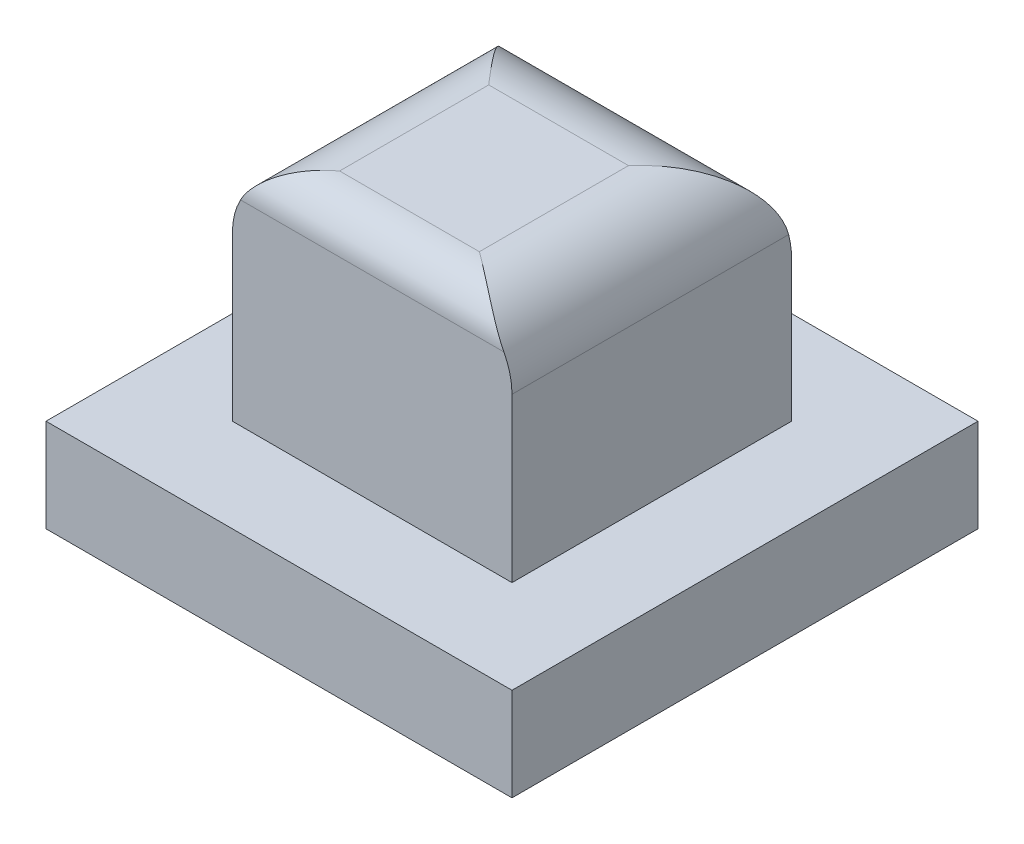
from build123d import *
from OCP.BRepFilletAPI import BRepFilletAPI_MakeFillet

# Parameters (mm, degrees)
SKETCH1_W      = 100
SKETCH1_H      = 20
EXTRUDE1_DEPTH = 50
SKETCH2_W      = 60
SKETCH2_H      = 60
EXTRUDE2_DEPTH = 50
FILLET6_R1     = 8
FILLET6_R2     = 15
FILLET6_R3     = 20


with BuildPart() as part:
    # Sketch1 → Extrude1 (new, symmetric)
    with BuildSketch(Plane.XY):
        with Locations((0, 10)):
            Rectangle(SKETCH1_W, SKETCH1_H)
    extrude(amount=EXTRUDE1_DEPTH, both=True)

    # Sketch2 → Extrude2 (add)
    with BuildSketch(Plane(origin=(0, 20, 0), x_dir=(-1, 0, 0), z_dir=(0, 1, 0))):
        Rectangle(SKETCH2_W, SKETCH2_H)
    extrude(amount=EXTRUDE2_DEPTH)

    # Fillet6: one fillet with a radius per group of edges: ONE call of the kernel's fillet builder (fillet() takes one radius for all edges)
    fillet6_edges_1 = [part.edges().sort_by_distance(p)[0] for p in [
        (0, 70, 30),
    ]]
    fillet6_edges_2 = [part.edges().sort_by_distance(p)[0] for p in [
        (30, 70, 0),
        (-30, 70, 0),
    ]]
    fillet6_edges_3 = [part.edges().sort_by_distance(p)[0] for p in [
        (0, 70, -30),
    ]]
    fillet6 = BRepFilletAPI_MakeFillet(part.part.solid().wrapped)
    for e in fillet6_edges_1:
        fillet6.Add(FILLET6_R1, e.wrapped)
    for e in fillet6_edges_2:
        fillet6.Add(FILLET6_R2, e.wrapped)
    for e in fillet6_edges_3:
        fillet6.Add(FILLET6_R3, e.wrapped)
    add(Compound.cast(fillet6.Shape()), mode=Mode.REPLACE)


solid = part.part
